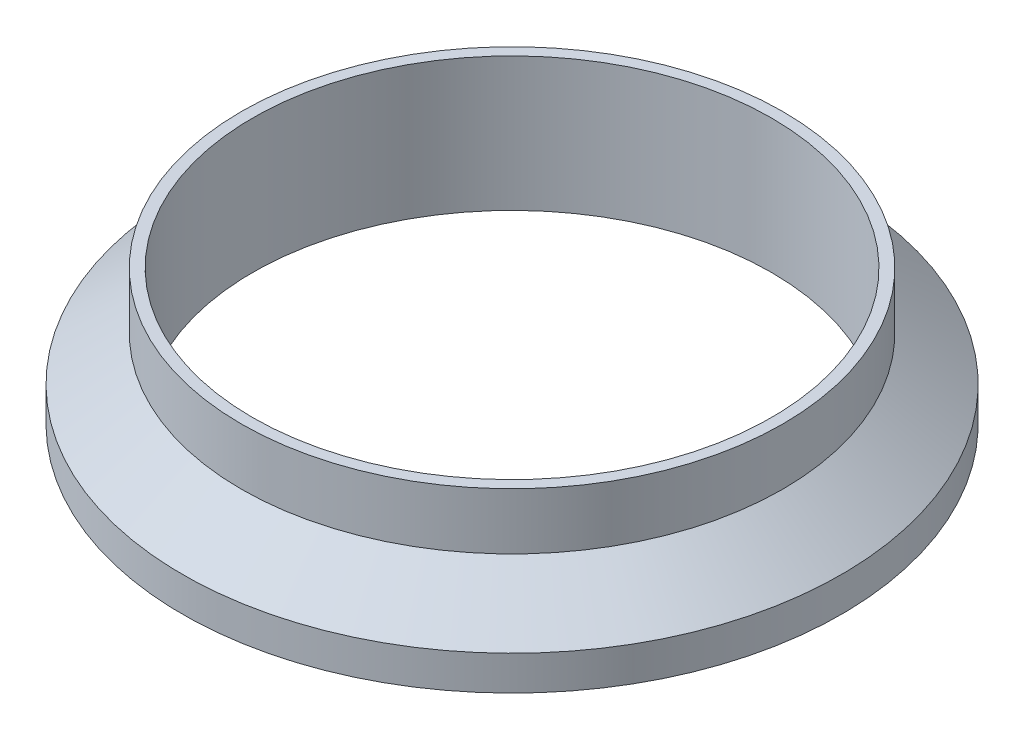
ISO-10303-21;
HEADER;
FILE_DESCRIPTION(('STEP AP214'),'2;1');
FILE_NAME('part.step','',(''),(''),'','','');
FILE_SCHEMA(('AUTOMOTIVE_DESIGN { 1 0 10303 214 1 1 1 1 }'));
ENDSEC;
DATA;
#1=APPLICATION_CONTEXT('core data for automotive mechanical design processes');
#2=APPLICATION_PROTOCOL_DEFINITION('international standard','automotive_design',2000,#1);
#3=PRODUCT_CONTEXT('',#1,'mechanical');
#4=PRODUCT('Part','Part','',(#3));
#5=PRODUCT_RELATED_PRODUCT_CATEGORY('part','',(#4));
#6=PRODUCT_DEFINITION_FORMATION('','',#4);
#7=PRODUCT_DEFINITION_CONTEXT('part definition',#1,'design');
#8=PRODUCT_DEFINITION('design','',#6,#7);
#9=PRODUCT_DEFINITION_SHAPE('','',#8);
#10=(LENGTH_UNIT() NAMED_UNIT(*) SI_UNIT(.MILLI.,.METRE.));
#11=(NAMED_UNIT(*) PLANE_ANGLE_UNIT() SI_UNIT($,.RADIAN.));
#12=(NAMED_UNIT(*) SI_UNIT($,.STERADIAN.) SOLID_ANGLE_UNIT());
#13=UNCERTAINTY_MEASURE_WITH_UNIT(LENGTH_MEASURE(1.E-05),#10,'distance_accuracy_value','');
#14=(GEOMETRIC_REPRESENTATION_CONTEXT(3) GLOBAL_UNCERTAINTY_ASSIGNED_CONTEXT((#13)) GLOBAL_UNIT_ASSIGNED_CONTEXT((#10,
#11,#12)) REPRESENTATION_CONTEXT('',''));
#15=CARTESIAN_POINT('',(0.,0.,0.));
#16=DIRECTION('',(0.,0.,1.));
#17=DIRECTION('',(1.,0.,0.));
#18=AXIS2_PLACEMENT_3D('',#15,#16,#17);
#19=CARTESIAN_POINT('',(-48.6918,0.288822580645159,0.));
#20=DIRECTION('',(0.,1.,0.));
#21=DIRECTION('',(0.,0.,1.));
#22=AXIS2_PLACEMENT_3D('',#19,#20,#21);
#23=PLANE('',#22);
#24=CARTESIAN_POINT('',(0.,0.288822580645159,0.));
#25=DIRECTION('',(0.,-1.,0.));
#26=DIRECTION('',(0.,0.,-1.));
#27=AXIS2_PLACEMENT_3D('',#24,#25,#26);
#28=CIRCLE('',#27,48.6918);
#29=CARTESIAN_POINT('',(0.,0.288822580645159,-48.6918));
#30=VERTEX_POINT('',#29);
#31=EDGE_CURVE('E10',#30,#30,#28,.T.);
#32=ORIENTED_EDGE('',*,*,#31,.F.);
#33=EDGE_LOOP('',(#32));
#34=FACE_BOUND('',#33,.T.);
#35=CARTESIAN_POINT('',(0.,0.288822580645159,0.));
#36=DIRECTION('',(0.,-1.,0.));
#37=DIRECTION('',(0.,0.,-1.));
#38=AXIS2_PLACEMENT_3D('',#35,#36,#37);
#39=CIRCLE('',#38,52.8126486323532);
#40=CARTESIAN_POINT('',(0.,0.288822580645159,-52.8126486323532));
#41=VERTEX_POINT('',#40);
#42=EDGE_CURVE('E59',#41,#41,#39,.T.);
#43=ORIENTED_EDGE('',*,*,#42,.T.);
#44=EDGE_LOOP('',(#43));
#45=FACE_BOUND('',#44,.T.);
#46=ADVANCED_FACE('F31',(#34,#45),#23,.F.);
#47=CARTESIAN_POINT('',(0.,0.,0.));
#48=DIRECTION('',(0.,-1.,0.));
#49=DIRECTION('',(0.,0.,-1.));
#50=AXIS2_PLACEMENT_3D('',#47,#48,#49);
#51=CYLINDRICAL_SURFACE('',#50,48.6918);
#52=CARTESIAN_POINT('',(0.,25.4,0.));
#53=DIRECTION('',(0.,-1.,0.));
#54=DIRECTION('',(0.,0.,-1.));
#55=AXIS2_PLACEMENT_3D('',#52,#53,#54);
#56=CIRCLE('',#55,48.6918);
#57=CARTESIAN_POINT('',(0.,25.4,-48.6918));
#58=VERTEX_POINT('',#57);
#59=EDGE_CURVE('E37',#58,#58,#56,.T.);
#60=ORIENTED_EDGE('',*,*,#59,.F.);
#61=EDGE_LOOP('',(#60));
#62=FACE_BOUND('',#61,.T.);
#63=ORIENTED_EDGE('',*,*,#31,.T.);
#64=EDGE_LOOP('',(#63));
#65=FACE_BOUND('',#64,.T.);
#66=ADVANCED_FACE('F96',(#62,#65),#51,.F.);
#67=CARTESIAN_POINT('',(-48.6918,25.4,0.));
#68=DIRECTION('',(0.,-1.,0.));
#69=DIRECTION('',(0.,0.,-1.));
#70=AXIS2_PLACEMENT_3D('',#67,#68,#69);
#71=PLANE('',#70);
#72=CARTESIAN_POINT('',(0.,25.4,0.));
#73=DIRECTION('',(0.,-1.,0.));
#74=DIRECTION('',(0.,0.,-1.));
#75=AXIS2_PLACEMENT_3D('',#72,#73,#74);
#76=CIRCLE('',#75,50.8);
#77=CARTESIAN_POINT('',(0.,25.4,-50.8));
#78=VERTEX_POINT('',#77);
#79=EDGE_CURVE('E41',#78,#78,#76,.T.);
#80=ORIENTED_EDGE('',*,*,#79,.F.);
#81=EDGE_LOOP('',(#80));
#82=FACE_BOUND('',#81,.T.);
#83=ORIENTED_EDGE('',*,*,#59,.T.);
#84=EDGE_LOOP('',(#83));
#85=FACE_BOUND('',#84,.T.);
#86=ADVANCED_FACE('F91',(#82,#85),#71,.F.);
#87=CARTESIAN_POINT('',(0.,0.,0.));
#88=DIRECTION('',(0.,-1.,0.));
#89=DIRECTION('',(0.,0.,-1.));
#90=AXIS2_PLACEMENT_3D('',#87,#88,#89);
#91=CYLINDRICAL_SURFACE('',#90,50.8);
#92=CARTESIAN_POINT('',(0.,14.8030186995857,0.));
#93=DIRECTION('',(0.,-1.,0.));
#94=DIRECTION('',(0.,0.,-1.));
#95=AXIS2_PLACEMENT_3D('',#92,#93,#94);
#96=CIRCLE('',#95,50.8);
#97=CARTESIAN_POINT('',(0.,14.8030186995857,-50.8));
#98=VERTEX_POINT('',#97);
#99=EDGE_CURVE('E45',#98,#98,#96,.T.);
#100=ORIENTED_EDGE('',*,*,#99,.F.);
#101=EDGE_LOOP('',(#100));
#102=FACE_BOUND('',#101,.T.);
#103=ORIENTED_EDGE('',*,*,#79,.T.);
#104=EDGE_LOOP('',(#103));
#105=FACE_BOUND('',#104,.T.);
#106=ADVANCED_FACE('F85',(#102,#105),#91,.T.);
#107=CARTESIAN_POINT('',(0.,14.8030186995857,0.));
#108=DIRECTION('',(0.,-1.,0.));
#109=DIRECTION('',(0.,0.,-1.));
#110=AXIS2_PLACEMENT_3D('',#107,#108,#109);
#111=CONICAL_SURFACE('',#110,50.8,0.925024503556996);
#112=CARTESIAN_POINT('',(0.,6.477,0.));
#113=DIRECTION('',(0.,-1.,0.));
#114=DIRECTION('',(0.,0.,-1.));
#115=AXIS2_PLACEMENT_3D('',#112,#113,#114);
#116=CIRCLE('',#115,61.849);
#117=CARTESIAN_POINT('',(0.,6.477,-61.849));
#118=VERTEX_POINT('',#117);
#119=EDGE_CURVE('E50',#118,#118,#116,.T.);
#120=ORIENTED_EDGE('',*,*,#119,.F.);
#121=EDGE_LOOP('',(#120));
#122=FACE_BOUND('',#121,.T.);
#123=ORIENTED_EDGE('',*,*,#99,.T.);
#124=EDGE_LOOP('',(#123));
#125=FACE_BOUND('',#124,.T.);
#126=ADVANCED_FACE('F79',(#122,#125),#111,.T.);
#127=CARTESIAN_POINT('',(0.,0.,0.));
#128=DIRECTION('',(0.,-1.,0.));
#129=DIRECTION('',(0.,0.,-1.));
#130=AXIS2_PLACEMENT_3D('',#127,#128,#129);
#131=CYLINDRICAL_SURFACE('',#130,61.849);
#132=CARTESIAN_POINT('',(0.,0.,0.));
#133=DIRECTION('',(0.,-1.,0.));
#134=DIRECTION('',(0.,0.,-1.));
#135=AXIS2_PLACEMENT_3D('',#132,#133,#134);
#136=CIRCLE('',#135,61.849);
#137=CARTESIAN_POINT('',(0.,0.,-61.849));
#138=VERTEX_POINT('',#137);
#139=EDGE_CURVE('E53',#138,#138,#136,.T.);
#140=ORIENTED_EDGE('',*,*,#139,.F.);
#141=EDGE_LOOP('',(#140));
#142=FACE_BOUND('',#141,.T.);
#143=ORIENTED_EDGE('',*,*,#119,.T.);
#144=EDGE_LOOP('',(#143));
#145=FACE_BOUND('',#144,.T.);
#146=ADVANCED_FACE('F73',(#142,#145),#131,.T.);
#147=CARTESIAN_POINT('',(-61.849,0.,0.));
#148=DIRECTION('',(0.,1.,0.));
#149=DIRECTION('',(0.,0.,1.));
#150=AXIS2_PLACEMENT_3D('',#147,#148,#149);
#151=PLANE('',#150);
#152=CARTESIAN_POINT('',(0.,0.,0.));
#153=DIRECTION('',(0.,-1.,0.));
#154=DIRECTION('',(0.,0.,-1.));
#155=AXIS2_PLACEMENT_3D('',#152,#153,#154);
#156=CIRCLE('',#155,58.2412590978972);
#157=CARTESIAN_POINT('',(0.,0.,-58.2412590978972));
#158=VERTEX_POINT('',#157);
#159=EDGE_CURVE('E56',#158,#158,#156,.T.);
#160=ORIENTED_EDGE('',*,*,#159,.F.);
#161=EDGE_LOOP('',(#160));
#162=FACE_BOUND('',#161,.T.);
#163=ORIENTED_EDGE('',*,*,#139,.T.);
#164=EDGE_LOOP('',(#163));
#165=FACE_BOUND('',#164,.T.);
#166=ADVANCED_FACE('F67',(#162,#165),#151,.F.);
#167=CARTESIAN_POINT('',(0.,-0.381,0.));
#168=DIRECTION('',(0.,-1.,0.));
#169=DIRECTION('',(0.,0.,-1.));
#170=AXIS2_PLACEMENT_3D('',#167,#168,#169);
#171=TOROIDAL_SURFACE('',#170,55.499,2.7686);
#172=ORIENTED_EDGE('',*,*,#42,.F.);
#173=EDGE_LOOP('',(#172));
#174=FACE_BOUND('',#173,.T.);
#175=ORIENTED_EDGE('',*,*,#159,.T.);
#176=EDGE_LOOP('',(#175));
#177=FACE_BOUND('',#176,.T.);
#178=ADVANCED_FACE('F64',(#174,#177),#171,.F.);
#179=CLOSED_SHELL('',(#46,#66,#86,#106,#126,#146,#166,#178));
#180=MANIFOLD_SOLID_BREP('B2',#179);
#181=ADVANCED_BREP_SHAPE_REPRESENTATION('',(#18,#180),#14);
#182=SHAPE_DEFINITION_REPRESENTATION(#9,#181);
ENDSEC;
END-ISO-10303-21;
